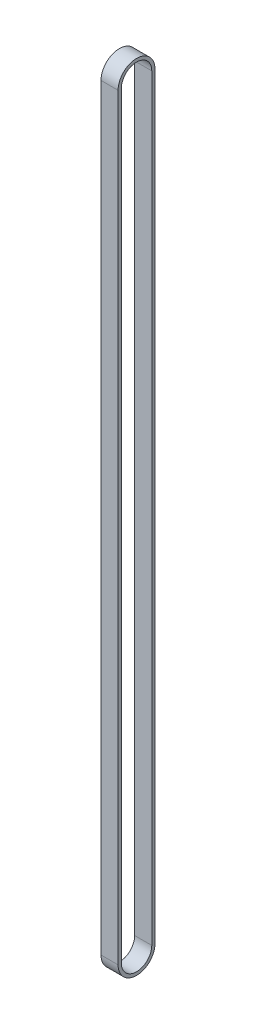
ISO-10303-21;
HEADER;
FILE_DESCRIPTION(('STEP AP214'),'2;1');
FILE_NAME('part.step','',(''),(''),'','','');
FILE_SCHEMA(('AUTOMOTIVE_DESIGN { 1 0 10303 214 1 1 1 1 }'));
ENDSEC;
DATA;
#1=APPLICATION_CONTEXT('core data for automotive mechanical design processes');
#2=APPLICATION_PROTOCOL_DEFINITION('international standard','automotive_design',2000,#1);
#3=PRODUCT_CONTEXT('',#1,'mechanical');
#4=PRODUCT('Part','Part','',(#3));
#5=PRODUCT_RELATED_PRODUCT_CATEGORY('part','',(#4));
#6=PRODUCT_DEFINITION_FORMATION('','',#4);
#7=PRODUCT_DEFINITION_CONTEXT('part definition',#1,'design');
#8=PRODUCT_DEFINITION('design','',#6,#7);
#9=PRODUCT_DEFINITION_SHAPE('','',#8);
#10=(LENGTH_UNIT() NAMED_UNIT(*) SI_UNIT(.MILLI.,.METRE.));
#11=(NAMED_UNIT(*) PLANE_ANGLE_UNIT() SI_UNIT($,.RADIAN.));
#12=(NAMED_UNIT(*) SI_UNIT($,.STERADIAN.) SOLID_ANGLE_UNIT());
#13=UNCERTAINTY_MEASURE_WITH_UNIT(LENGTH_MEASURE(1.E-05),#10,'distance_accuracy_value','');
#14=(GEOMETRIC_REPRESENTATION_CONTEXT(3) GLOBAL_UNCERTAINTY_ASSIGNED_CONTEXT((#13)) GLOBAL_UNIT_ASSIGNED_CONTEXT((#10,
#11,#12)) REPRESENTATION_CONTEXT('',''));
#15=CARTESIAN_POINT('',(0.,0.,0.));
#16=DIRECTION('',(0.,0.,1.));
#17=DIRECTION('',(1.,0.,0.));
#18=AXIS2_PLACEMENT_3D('',#15,#16,#17);
#19=CARTESIAN_POINT('',(-3.2,141.75,6.9));
#20=DIRECTION('',(0.,0.,1.));
#21=DIRECTION('',(1.,0.,0.));
#22=AXIS2_PLACEMENT_3D('',#19,#20,#21);
#23=PLANE('',#22);
#24=DIRECTION('',(1.,0.,0.));
#25=VECTOR('',#24,1.);
#26=CARTESIAN_POINT('',(-3.2,141.75,6.9));
#27=LINE('',#26,#25);
#28=CARTESIAN_POINT('',(-3.2,141.75,6.9));
#29=VERTEX_POINT('',#28);
#30=CARTESIAN_POINT('',(3.2,141.75,6.9));
#31=VERTEX_POINT('',#30);
#32=EDGE_CURVE('E88',#29,#31,#27,.T.);
#33=ORIENTED_EDGE('',*,*,#32,.F.);
#34=DIRECTION('',(0.,1.,0.));
#35=VECTOR('',#34,1.);
#36=CARTESIAN_POINT('',(-3.2,0.,6.9));
#37=LINE('',#36,#35);
#38=CARTESIAN_POINT('',(-3.2,-141.75,6.9));
#39=VERTEX_POINT('',#38);
#40=EDGE_CURVE('E152',#29,#39,#37,.F.);
#41=ORIENTED_EDGE('',*,*,#40,.T.);
#42=DIRECTION('',(1.,0.,0.));
#43=VECTOR('',#42,1.);
#44=CARTESIAN_POINT('',(-3.2,-141.75,6.9));
#45=LINE('',#44,#43);
#46=CARTESIAN_POINT('',(3.2,-141.75,6.9));
#47=VERTEX_POINT('',#46);
#48=EDGE_CURVE('E139',#47,#39,#45,.F.);
#49=ORIENTED_EDGE('',*,*,#48,.F.);
#50=DIRECTION('',(0.,1.,0.));
#51=VECTOR('',#50,1.);
#52=CARTESIAN_POINT('',(3.2,0.,6.9));
#53=LINE('',#52,#51);
#54=EDGE_CURVE('E92',#31,#47,#53,.F.);
#55=ORIENTED_EDGE('',*,*,#54,.F.);
#56=EDGE_LOOP('',(#33,#41,#49,#55));
#57=FACE_BOUND('',#56,.T.);
#58=ADVANCED_FACE('F17',(#57),#23,.T.);
#59=CARTESIAN_POINT('',(-3.2,141.75,-5.7));
#60=DIRECTION('',(0.,0.,1.));
#61=DIRECTION('',(1.,0.,0.));
#62=AXIS2_PLACEMENT_3D('',#59,#60,#61);
#63=PLANE('',#62);
#64=DIRECTION('',(1.,0.,0.));
#65=VECTOR('',#64,1.);
#66=CARTESIAN_POINT('',(-3.2,141.75,-5.7));
#67=LINE('',#66,#65);
#68=CARTESIAN_POINT('',(3.2,141.75,-5.7));
#69=VERTEX_POINT('',#68);
#70=CARTESIAN_POINT('',(-3.2,141.75,-5.7));
#71=VERTEX_POINT('',#70);
#72=EDGE_CURVE('E125',#69,#71,#67,.F.);
#73=ORIENTED_EDGE('',*,*,#72,.T.);
#74=DIRECTION('',(0.,1.,0.));
#75=VECTOR('',#74,1.);
#76=CARTESIAN_POINT('',(-3.2,0.,-5.7));
#77=LINE('',#76,#75);
#78=CARTESIAN_POINT('',(-3.2,-141.75,-5.7));
#79=VERTEX_POINT('',#78);
#80=EDGE_CURVE('E149',#71,#79,#77,.F.);
#81=ORIENTED_EDGE('',*,*,#80,.T.);
#82=DIRECTION('',(1.,0.,0.));
#83=VECTOR('',#82,1.);
#84=CARTESIAN_POINT('',(-3.2,-141.75,-5.7));
#85=LINE('',#84,#83);
#86=CARTESIAN_POINT('',(3.2,-141.75,-5.7));
#87=VERTEX_POINT('',#86);
#88=EDGE_CURVE('E136',#79,#87,#85,.T.);
#89=ORIENTED_EDGE('',*,*,#88,.T.);
#90=DIRECTION('',(0.,1.,0.));
#91=VECTOR('',#90,1.);
#92=CARTESIAN_POINT('',(3.2,0.,-5.7));
#93=LINE('',#92,#91);
#94=EDGE_CURVE('E114',#69,#87,#93,.F.);
#95=ORIENTED_EDGE('',*,*,#94,.F.);
#96=EDGE_LOOP('',(#73,#81,#89,#95));
#97=FACE_BOUND('',#96,.T.);
#98=ADVANCED_FACE('F183',(#97),#63,.T.);
#99=CARTESIAN_POINT('',(-3.2,-141.75,0.));
#100=DIRECTION('',(1.,0.,0.));
#101=DIRECTION('',(0.,0.,-1.));
#102=AXIS2_PLACEMENT_3D('',#99,#100,#101);
#103=CYLINDRICAL_SURFACE('',#102,5.7);
#104=CARTESIAN_POINT('',(3.2,-141.75,0.));
#105=DIRECTION('',(1.,0.,0.));
#106=DIRECTION('',(0.,0.,-1.));
#107=AXIS2_PLACEMENT_3D('',#104,#105,#106);
#108=CIRCLE('',#107,5.7);
#109=CARTESIAN_POINT('',(3.2,-141.75,5.7));
#110=VERTEX_POINT('',#109);
#111=EDGE_CURVE('E91',#87,#110,#108,.F.);
#112=ORIENTED_EDGE('',*,*,#111,.F.);
#113=ORIENTED_EDGE('',*,*,#88,.F.);
#114=CARTESIAN_POINT('',(-3.2,-141.75,0.));
#115=DIRECTION('',(1.,0.,0.));
#116=DIRECTION('',(0.,0.,-1.));
#117=AXIS2_PLACEMENT_3D('',#114,#115,#116);
#118=CIRCLE('',#117,5.7);
#119=CARTESIAN_POINT('',(-3.2,-141.75,5.7));
#120=VERTEX_POINT('',#119);
#121=EDGE_CURVE('E145',#79,#120,#118,.F.);
#122=ORIENTED_EDGE('',*,*,#121,.T.);
#123=DIRECTION('',(-1.,0.,0.));
#124=VECTOR('',#123,1.);
#125=CARTESIAN_POINT('',(-3.2,-141.75,5.7));
#126=LINE('',#125,#124);
#127=EDGE_CURVE('E132',#110,#120,#126,.T.);
#128=ORIENTED_EDGE('',*,*,#127,.F.);
#129=EDGE_LOOP('',(#112,#113,#122,#128));
#130=FACE_BOUND('',#129,.T.);
#131=ADVANCED_FACE('F166',(#130),#103,.F.);
#132=CARTESIAN_POINT('',(-3.2,-141.75,5.7));
#133=DIRECTION('',(0.,0.,-1.));
#134=DIRECTION('',(-1.,0.,0.));
#135=AXIS2_PLACEMENT_3D('',#132,#133,#134);
#136=PLANE('',#135);
#137=ORIENTED_EDGE('',*,*,#127,.T.);
#138=DIRECTION('',(0.,1.,0.));
#139=VECTOR('',#138,1.);
#140=CARTESIAN_POINT('',(-3.2,0.,5.7));
#141=LINE('',#140,#139);
#142=CARTESIAN_POINT('',(-3.2,141.75,5.7));
#143=VERTEX_POINT('',#142);
#144=EDGE_CURVE('E110',#120,#143,#141,.T.);
#145=ORIENTED_EDGE('',*,*,#144,.T.);
#146=DIRECTION('',(1.,0.,0.));
#147=VECTOR('',#146,1.);
#148=CARTESIAN_POINT('',(-3.2,141.75,5.7));
#149=LINE('',#148,#147);
#150=CARTESIAN_POINT('',(3.2,141.75,5.7));
#151=VERTEX_POINT('',#150);
#152=EDGE_CURVE('E129',#143,#151,#149,.T.);
#153=ORIENTED_EDGE('',*,*,#152,.T.);
#154=DIRECTION('',(0.,1.,0.));
#155=VECTOR('',#154,1.);
#156=CARTESIAN_POINT('',(3.2,0.,5.7));
#157=LINE('',#156,#155);
#158=EDGE_CURVE('E119',#110,#151,#157,.T.);
#159=ORIENTED_EDGE('',*,*,#158,.F.);
#160=EDGE_LOOP('',(#137,#145,#153,#159));
#161=FACE_BOUND('',#160,.T.);
#162=ADVANCED_FACE('F173',(#161),#136,.T.);
#163=CARTESIAN_POINT('',(-3.2,141.75,0.));
#164=DIRECTION('',(1.,0.,0.));
#165=DIRECTION('',(0.,0.,-1.));
#166=AXIS2_PLACEMENT_3D('',#163,#164,#165);
#167=CYLINDRICAL_SURFACE('',#166,5.7);
#168=CARTESIAN_POINT('',(3.2,141.75,0.));
#169=DIRECTION('',(1.,0.,0.));
#170=DIRECTION('',(0.,0.,-1.));
#171=AXIS2_PLACEMENT_3D('',#168,#169,#170);
#172=CIRCLE('',#171,5.7);
#173=EDGE_CURVE('E118',#151,#69,#172,.F.);
#174=ORIENTED_EDGE('',*,*,#173,.F.);
#175=ORIENTED_EDGE('',*,*,#152,.F.);
#176=CARTESIAN_POINT('',(-3.2,141.75,0.));
#177=DIRECTION('',(1.,0.,0.));
#178=DIRECTION('',(0.,0.,-1.));
#179=AXIS2_PLACEMENT_3D('',#176,#177,#178);
#180=CIRCLE('',#179,5.7);
#181=EDGE_CURVE('E104',#143,#71,#180,.F.);
#182=ORIENTED_EDGE('',*,*,#181,.T.);
#183=ORIENTED_EDGE('',*,*,#72,.F.);
#184=EDGE_LOOP('',(#174,#175,#182,#183));
#185=FACE_BOUND('',#184,.T.);
#186=ADVANCED_FACE('F178',(#185),#167,.F.);
#187=CARTESIAN_POINT('',(-3.2,141.75,0.));
#188=DIRECTION('',(1.,0.,0.));
#189=DIRECTION('',(0.,0.,-1.));
#190=AXIS2_PLACEMENT_3D('',#187,#188,#189);
#191=CYLINDRICAL_SURFACE('',#190,6.9);
#192=DIRECTION('',(-1.,0.,0.));
#193=VECTOR('',#192,1.);
#194=CARTESIAN_POINT('',(-3.2,141.75,-6.9));
#195=LINE('',#194,#193);
#196=CARTESIAN_POINT('',(-3.2,141.75,-6.9));
#197=VERTEX_POINT('',#196);
#198=CARTESIAN_POINT('',(3.2,141.75,-6.9));
#199=VERTEX_POINT('',#198);
#200=EDGE_CURVE('E86',#197,#199,#195,.F.);
#201=ORIENTED_EDGE('',*,*,#200,.F.);
#202=CARTESIAN_POINT('',(-3.2,141.75,0.));
#203=DIRECTION('',(1.,0.,0.));
#204=DIRECTION('',(0.,0.,-1.));
#205=AXIS2_PLACEMENT_3D('',#202,#203,#204);
#206=CIRCLE('',#205,6.9);
#207=EDGE_CURVE('E142',#197,#29,#206,.T.);
#208=ORIENTED_EDGE('',*,*,#207,.T.);
#209=ORIENTED_EDGE('',*,*,#32,.T.);
#210=CARTESIAN_POINT('',(3.2,141.75,0.));
#211=DIRECTION('',(1.,0.,0.));
#212=DIRECTION('',(0.,0.,-1.));
#213=AXIS2_PLACEMENT_3D('',#210,#211,#212);
#214=CIRCLE('',#213,6.9);
#215=EDGE_CURVE('E20',#199,#31,#214,.T.);
#216=ORIENTED_EDGE('',*,*,#215,.F.);
#217=EDGE_LOOP('',(#201,#208,#209,#216));
#218=FACE_BOUND('',#217,.T.);
#219=ADVANCED_FACE('F83',(#218),#191,.T.);
#220=CARTESIAN_POINT('',(3.2,0.,0.));
#221=DIRECTION('',(1.,0.,0.));
#222=DIRECTION('',(0.,0.,-1.));
#223=AXIS2_PLACEMENT_3D('',#220,#221,#222);
#224=PLANE('',#223);
#225=ORIENTED_EDGE('',*,*,#173,.T.);
#226=ORIENTED_EDGE('',*,*,#94,.T.);
#227=ORIENTED_EDGE('',*,*,#111,.T.);
#228=ORIENTED_EDGE('',*,*,#158,.T.);
#229=EDGE_LOOP('',(#225,#226,#227,#228));
#230=FACE_BOUND('',#229,.T.);
#231=DIRECTION('',(0.,1.,0.));
#232=VECTOR('',#231,1.);
#233=CARTESIAN_POINT('',(3.2,-141.75,-6.9));
#234=LINE('',#233,#232);
#235=CARTESIAN_POINT('',(3.2,-141.75,-6.9));
#236=VERTEX_POINT('',#235);
#237=EDGE_CURVE('E94',#199,#236,#234,.F.);
#238=ORIENTED_EDGE('',*,*,#237,.F.);
#239=ORIENTED_EDGE('',*,*,#215,.T.);
#240=ORIENTED_EDGE('',*,*,#54,.T.);
#241=CARTESIAN_POINT('',(3.2,-141.75,0.));
#242=DIRECTION('',(1.,0.,0.));
#243=DIRECTION('',(0.,0.,-1.));
#244=AXIS2_PLACEMENT_3D('',#241,#242,#243);
#245=CIRCLE('',#244,6.9);
#246=EDGE_CURVE('E97',#236,#47,#245,.F.);
#247=ORIENTED_EDGE('',*,*,#246,.F.);
#248=EDGE_LOOP('',(#238,#239,#240,#247));
#249=FACE_BOUND('',#248,.T.);
#250=ADVANCED_FACE('F95',(#230,#249),#224,.T.);
#251=CARTESIAN_POINT('',(-3.2,-141.75,0.));
#252=DIRECTION('',(1.,0.,0.));
#253=DIRECTION('',(0.,0.,-1.));
#254=AXIS2_PLACEMENT_3D('',#251,#252,#253);
#255=CYLINDRICAL_SURFACE('',#254,6.9);
#256=ORIENTED_EDGE('',*,*,#48,.T.);
#257=CARTESIAN_POINT('',(-3.2,-141.75,0.));
#258=DIRECTION('',(1.,0.,0.));
#259=DIRECTION('',(0.,0.,-1.));
#260=AXIS2_PLACEMENT_3D('',#257,#258,#259);
#261=CIRCLE('',#260,6.9);
#262=CARTESIAN_POINT('',(-3.2,-141.75,-6.9));
#263=VERTEX_POINT('',#262);
#264=EDGE_CURVE('E40',#39,#263,#261,.T.);
#265=ORIENTED_EDGE('',*,*,#264,.T.);
#266=DIRECTION('',(-1.,0.,0.));
#267=VECTOR('',#266,1.);
#268=CARTESIAN_POINT('',(-3.2,-141.75,-6.9));
#269=LINE('',#268,#267);
#270=EDGE_CURVE('E27',#236,#263,#269,.T.);
#271=ORIENTED_EDGE('',*,*,#270,.F.);
#272=ORIENTED_EDGE('',*,*,#246,.T.);
#273=EDGE_LOOP('',(#256,#265,#271,#272));
#274=FACE_BOUND('',#273,.T.);
#275=ADVANCED_FACE('F194',(#274),#255,.T.);
#276=CARTESIAN_POINT('',(-3.2,0.,0.));
#277=DIRECTION('',(1.,0.,0.));
#278=DIRECTION('',(0.,0.,-1.));
#279=AXIS2_PLACEMENT_3D('',#276,#277,#278);
#280=PLANE('',#279);
#281=ORIENTED_EDGE('',*,*,#144,.F.);
#282=ORIENTED_EDGE('',*,*,#121,.F.);
#283=ORIENTED_EDGE('',*,*,#80,.F.);
#284=ORIENTED_EDGE('',*,*,#181,.F.);
#285=EDGE_LOOP('',(#281,#282,#283,#284));
#286=FACE_BOUND('',#285,.T.);
#287=ORIENTED_EDGE('',*,*,#264,.F.);
#288=ORIENTED_EDGE('',*,*,#40,.F.);
#289=ORIENTED_EDGE('',*,*,#207,.F.);
#290=DIRECTION('',(0.,1.,0.));
#291=VECTOR('',#290,1.);
#292=CARTESIAN_POINT('',(-3.2,-141.75,-6.9));
#293=LINE('',#292,#291);
#294=EDGE_CURVE('E11',#263,#197,#293,.T.);
#295=ORIENTED_EDGE('',*,*,#294,.F.);
#296=EDGE_LOOP('',(#287,#288,#289,#295));
#297=FACE_BOUND('',#296,.T.);
#298=ADVANCED_FACE('F201',(#286,#297),#280,.F.);
#299=CARTESIAN_POINT('',(-3.2,-141.75,-6.9));
#300=DIRECTION('',(0.,0.,-1.));
#301=DIRECTION('',(-1.,0.,0.));
#302=AXIS2_PLACEMENT_3D('',#299,#300,#301);
#303=PLANE('',#302);
#304=ORIENTED_EDGE('',*,*,#270,.T.);
#305=ORIENTED_EDGE('',*,*,#294,.T.);
#306=ORIENTED_EDGE('',*,*,#200,.T.);
#307=ORIENTED_EDGE('',*,*,#237,.T.);
#308=EDGE_LOOP('',(#304,#305,#306,#307));
#309=FACE_BOUND('',#308,.T.);
#310=ADVANCED_FACE('F102',(#309),#303,.T.);
#311=CLOSED_SHELL('',(#58,#98,#131,#162,#186,#219,#250,#275,#298,#310));
#312=MANIFOLD_SOLID_BREP('B1',#311);
#313=ADVANCED_BREP_SHAPE_REPRESENTATION('',(#18,#312),#14);
#314=SHAPE_DEFINITION_REPRESENTATION(#9,#313);
ENDSEC;
END-ISO-10303-21;
